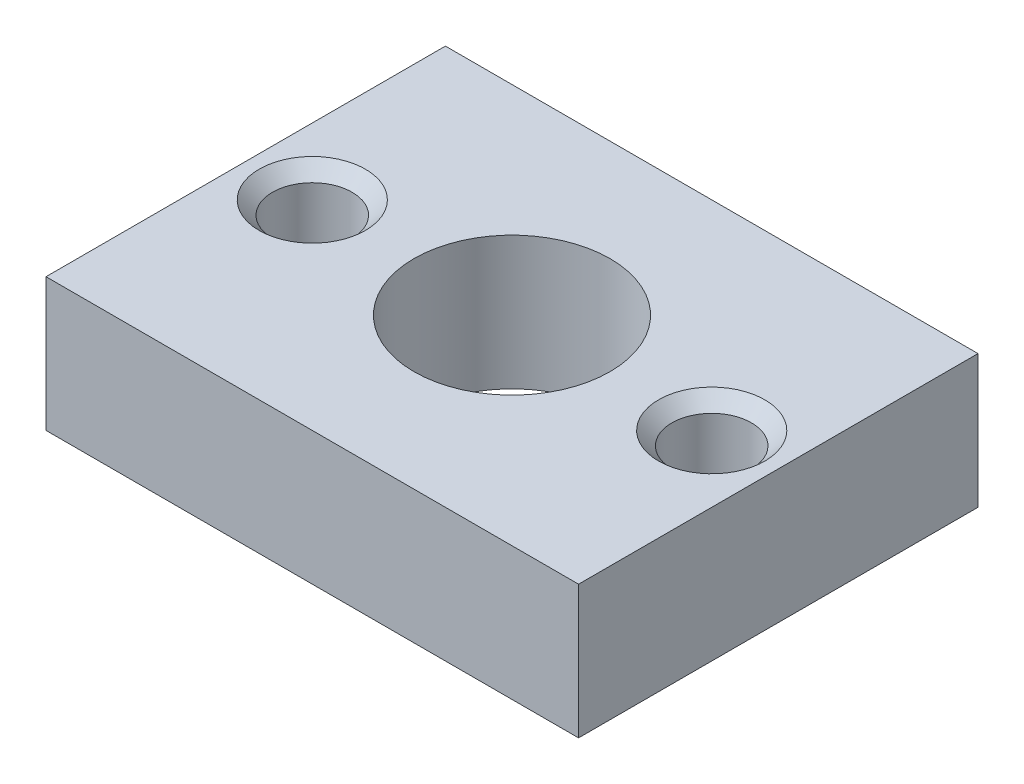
from build123d import *

# Parameters (mm, degrees)
SKETCH1_W                       = 25.4
SKETCH1_H                       = 19.05
EXTRUDE1_DEPTH                  = 6.35
F_6_CLEARANCE_HOLE1_D           = 3.7973
F_6_CLEARANCE_HOLE1_CSINK_D     = 5.0673
F_6_CLEARANCE_HOLE1_CSINK_ANGLE = 90
U_0_368_DIAMETER_HOLE1_D        = 9.3472


with BuildPart() as part:
    # Sketch1 → Extrude1 (new body)
    with BuildSketch(Plane(origin=(0, 0, 0), x_dir=(1, 0, 0), z_dir=(0, 1, 0))):
        Rectangle(SKETCH1_W, SKETCH1_H)
    extrude(amount=EXTRUDE1_DEPTH)

    # 6 Clearance Hole1 (through all)
    with Locations(Plane(origin=(-9.525, 6.35, 0), x_dir=(0, 0, 1), z_dir=(0, 1, 0))):
        with Locations((0, 0), (0, 19.05)):
            CounterSinkHole(F_6_CLEARANCE_HOLE1_D / 2, F_6_CLEARANCE_HOLE1_CSINK_D / 2, counter_sink_angle=F_6_CLEARANCE_HOLE1_CSINK_ANGLE)

    # U _0.368_ Diameter Hole1 (through all)
    with Locations(Plane.ZX.offset(6.35)):
        with Locations((0, 0)):
            Hole(U_0_368_DIAMETER_HOLE1_D / 2)


solid = part.part
